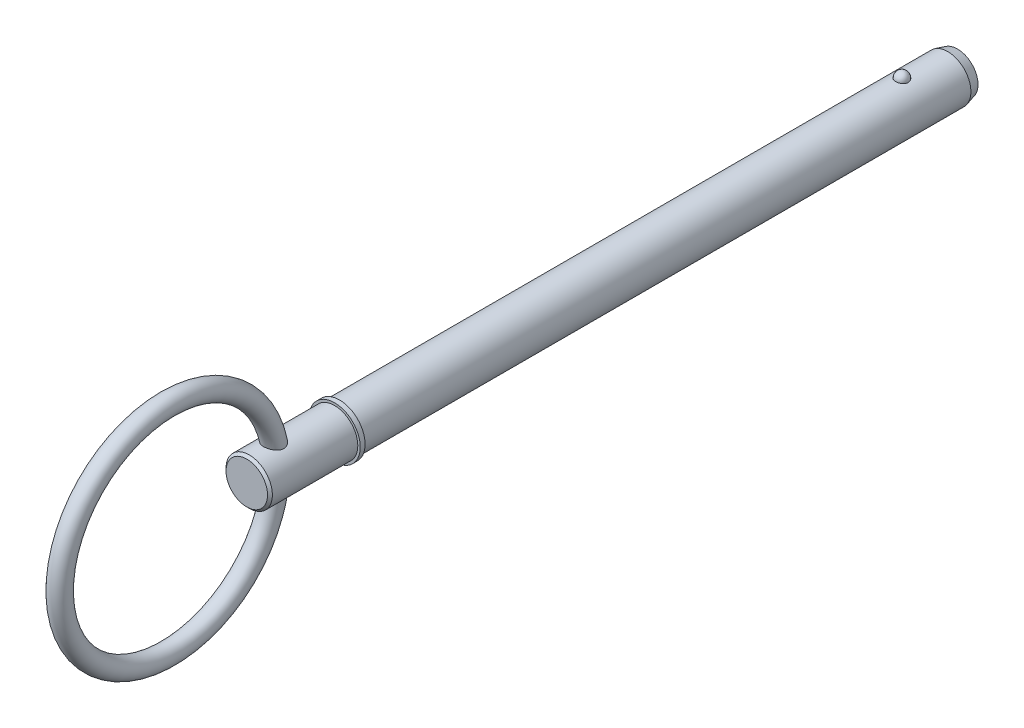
from build123d import *

# Parameters (mm, degrees)
SKETCH2_R           = 4.765
BOSS_EXTRUDE1_DEPTH = 114.3
BOSS_EXTRUDE2_START = 12.7
SKETCH3_R           = 4.765
BOSS_EXTRUDE2_DEPTH = 12.7
CHAMFER1_SIZE       = 2
CHAMFER1_SIZE2      = 0.535898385
SKETCH20_W          = 1
SKETCH20_H          = 5.265
SKETCH21_R          = 4.765
BOSS_EXTRUDE3_DEPTH = 19.05
CHAMFER2_SIZE       = 0.5
SKETCH24_R          = 2


with BuildPart() as part:
    # Sketch2 → Boss-Extrude1 (new body)
    with BuildSketch(Plane.XY):
        Circle(SKETCH2_R)
    extrude(amount=BOSS_EXTRUDE1_DEPTH)

    # Sketch3 → Boss-Extrude2 (add)
    with BuildSketch(Plane(origin=(0, 0, 0), x_dir=(-1, 0, 0), z_dir=(0, 0, -1)).offset(BOSS_EXTRUDE2_START)):
        Circle(SKETCH3_R)
    extrude(amount=-BOSS_EXTRUDE2_DEPTH)

    # Chamfer1
    chamfer1_edges = [part.edges().sort_by_distance(p)[0] for p in [
        (4.765, 0, -12.7),
    ]]
    chamfer1_side = [part.faces().sort_by_distance(p)[0] for p in [
        (4.765, 0, -6.35),
    ]]
    chamfer(chamfer1_edges, length=CHAMFER1_SIZE, length2=CHAMFER1_SIZE2, reference=chamfer1_side[0])

    # Sketch18 → Revolve1 (revolve)
    with BuildSketch(Plane(origin=(0, 0, 0), x_dir=(0, 0, -1), z_dir=(1, 0, 0))):
        with BuildLine():
            Line((1.29, 6.055), (1.29, 3.475))
            ThreePointArc((1.29, 3.475), (0, 4.765), (1.29, 6.055))
        make_face()
    revolve(axis=Axis((0, 6.055, -1.29), (0, -1, 0)))

    # Sketch20 → Revolve2 (revolve)
    with BuildSketch(Plane(origin=(0, 0, 0), x_dir=(0, 0, -1), z_dir=(1, 0, 0)), mode=Mode.PRIVATE) as revolve2_sk:
        with Locations((-114.8, 2.6325)):
            Rectangle(SKETCH20_W, SKETCH20_H)
    revolve(revolve2_sk.sketch.rotate(Axis((0, 0, 33.728787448), (0, 0, 1)), 90), axis=Axis((0, 0, 33.728787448), (0, 0, 1)))

    # Sketch21 → Boss-Extrude3 (add)
    with BuildSketch(Plane(origin=(0, 0, 114.3), x_dir=(-1, 0, 0), z_dir=(0, 0, -1))):
        Circle(SKETCH21_R)
    extrude(amount=-BOSS_EXTRUDE3_DEPTH)

    # Chamfer2
    chamfer2_edges = [part.edges().sort_by_distance(p)[0] for p in [
        (4.765, 0, 133.35),
    ]]
    chamfer(chamfer2_edges, length=CHAMFER2_SIZE)

    # Sweep1: sweep along a path in Sketch23
    with BuildLine(Plane(origin=(0, 0, 0), x_dir=(0, 0, -1), z_dir=(1, 0, 0))) as sweep1_path:
        CenterArc((-149.575, 0), 22.225, 0, 360)
    # Sketch24 → Sweep1 (sweep)
    with BuildSketch(Plane(origin=(0, 0, 0), x_dir=(1, 0, 0), z_dir=(0, 1, 0))):
        with Locations((0, -127.35)):
            Circle(SKETCH24_R)
    sweep(path=sweep1_path.line)


solid = part.part
